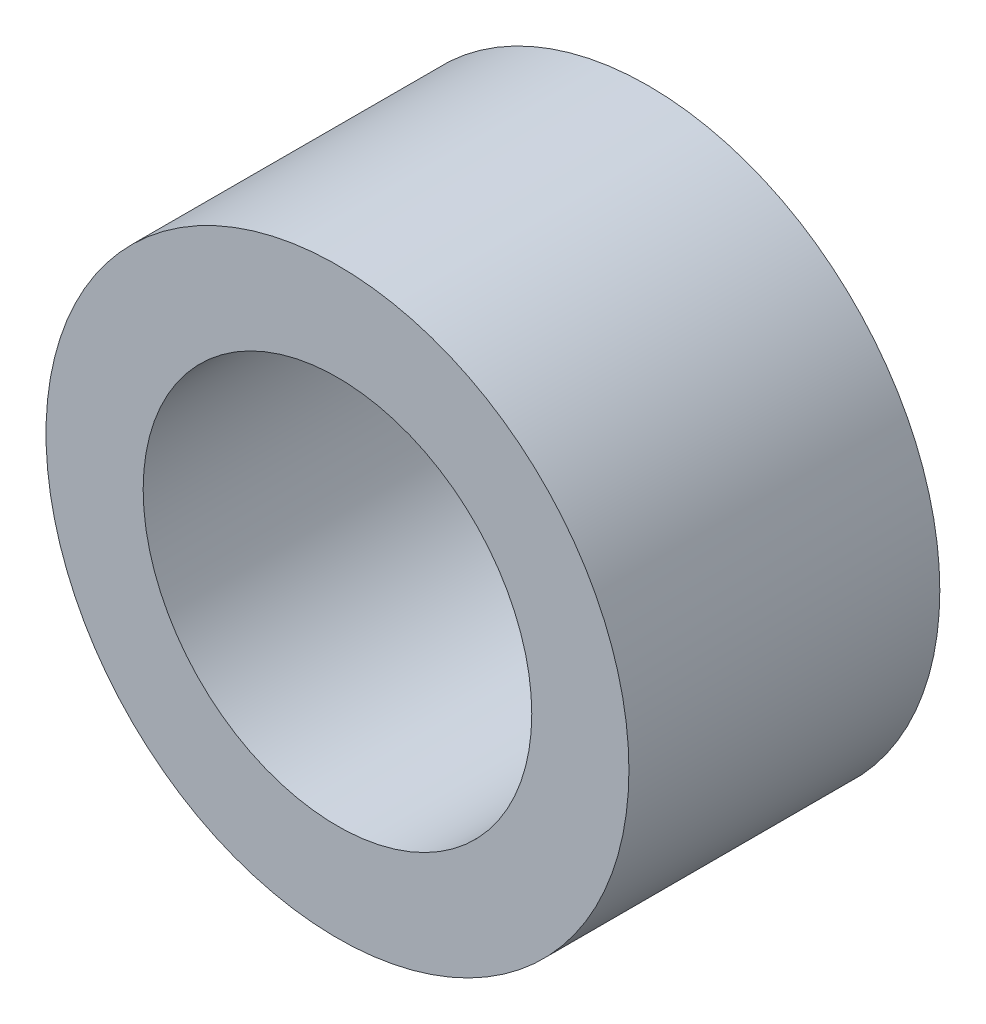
ISO-10303-21;
HEADER;
FILE_DESCRIPTION(('STEP AP214'),'2;1');
FILE_NAME('part.step','',(''),(''),'','','');
FILE_SCHEMA(('AUTOMOTIVE_DESIGN { 1 0 10303 214 1 1 1 1 }'));
ENDSEC;
DATA;
#1=APPLICATION_CONTEXT('core data for automotive mechanical design processes');
#2=APPLICATION_PROTOCOL_DEFINITION('international standard','automotive_design',2000,#1);
#3=PRODUCT_CONTEXT('',#1,'mechanical');
#4=PRODUCT('Part','Part','',(#3));
#5=PRODUCT_RELATED_PRODUCT_CATEGORY('part','',(#4));
#6=PRODUCT_DEFINITION_FORMATION('','',#4);
#7=PRODUCT_DEFINITION_CONTEXT('part definition',#1,'design');
#8=PRODUCT_DEFINITION('design','',#6,#7);
#9=PRODUCT_DEFINITION_SHAPE('','',#8);
#10=(LENGTH_UNIT() NAMED_UNIT(*) SI_UNIT(.MILLI.,.METRE.));
#11=(NAMED_UNIT(*) PLANE_ANGLE_UNIT() SI_UNIT($,.RADIAN.));
#12=(NAMED_UNIT(*) SI_UNIT($,.STERADIAN.) SOLID_ANGLE_UNIT());
#13=UNCERTAINTY_MEASURE_WITH_UNIT(LENGTH_MEASURE(1.E-05),#10,'distance_accuracy_value','');
#14=(GEOMETRIC_REPRESENTATION_CONTEXT(3) GLOBAL_UNCERTAINTY_ASSIGNED_CONTEXT((#13)) GLOBAL_UNIT_ASSIGNED_CONTEXT((#10,
#11,#12)) REPRESENTATION_CONTEXT('',''));
#15=CARTESIAN_POINT('',(0.,0.,0.));
#16=DIRECTION('',(0.,0.,1.));
#17=DIRECTION('',(1.,0.,0.));
#18=AXIS2_PLACEMENT_3D('',#15,#16,#17);
#19=CARTESIAN_POINT('',(0.,0.,-58.4264068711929));
#20=DIRECTION('',(0.,0.,1.));
#21=DIRECTION('',(1.,0.,0.));
#22=AXIS2_PLACEMENT_3D('',#19,#20,#21);
#23=CYLINDRICAL_SURFACE('',#22,15.);
#24=CARTESIAN_POINT('',(0.,0.,0.));
#25=DIRECTION('',(0.,0.,1.));
#26=DIRECTION('',(1.,0.,0.));
#27=AXIS2_PLACEMENT_3D('',#24,#25,#26);
#28=CIRCLE('',#27,15.);
#29=CARTESIAN_POINT('',(15.,0.,0.));
#30=VERTEX_POINT('',#29);
#31=EDGE_CURVE('E37',#30,#30,#28,.T.);
#32=ORIENTED_EDGE('',*,*,#31,.F.);
#33=EDGE_LOOP('',(#32));
#34=FACE_BOUND('',#33,.T.);
#35=CARTESIAN_POINT('',(0.,0.,-16.));
#36=DIRECTION('',(0.,0.,-1.));
#37=DIRECTION('',(-1.,0.,0.));
#38=AXIS2_PLACEMENT_3D('',#35,#36,#37);
#39=CIRCLE('',#38,15.);
#40=CARTESIAN_POINT('',(-15.,0.,-16.));
#41=VERTEX_POINT('',#40);
#42=EDGE_CURVE('E46',#41,#41,#39,.F.);
#43=ORIENTED_EDGE('',*,*,#42,.T.);
#44=EDGE_LOOP('',(#43));
#45=FACE_BOUND('',#44,.T.);
#46=ADVANCED_FACE('F30',(#34,#45),#23,.T.);
#47=CARTESIAN_POINT('',(0.,0.,-58.4264068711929));
#48=DIRECTION('',(0.,0.,1.));
#49=DIRECTION('',(1.,0.,0.));
#50=AXIS2_PLACEMENT_3D('',#47,#48,#49);
#51=CYLINDRICAL_SURFACE('',#50,10.);
#52=CARTESIAN_POINT('',(0.,0.,0.));
#53=DIRECTION('',(0.,0.,1.));
#54=DIRECTION('',(1.,0.,0.));
#55=AXIS2_PLACEMENT_3D('',#52,#53,#54);
#56=CIRCLE('',#55,10.);
#57=CARTESIAN_POINT('',(10.,0.,0.));
#58=VERTEX_POINT('',#57);
#59=EDGE_CURVE('E41',#58,#58,#56,.T.);
#60=ORIENTED_EDGE('',*,*,#59,.T.);
#61=EDGE_LOOP('',(#60));
#62=FACE_BOUND('',#61,.T.);
#63=CARTESIAN_POINT('',(0.,0.,-16.));
#64=DIRECTION('',(0.,0.,-1.));
#65=DIRECTION('',(-1.,0.,0.));
#66=AXIS2_PLACEMENT_3D('',#63,#64,#65);
#67=CIRCLE('',#66,10.);
#68=CARTESIAN_POINT('',(-10.,0.,-16.));
#69=VERTEX_POINT('',#68);
#70=EDGE_CURVE('E10',#69,#69,#67,.F.);
#71=ORIENTED_EDGE('',*,*,#70,.F.);
#72=EDGE_LOOP('',(#71));
#73=FACE_BOUND('',#72,.T.);
#74=ADVANCED_FACE('F57',(#62,#73),#51,.F.);
#75=CARTESIAN_POINT('',(0.,0.,0.));
#76=DIRECTION('',(0.,0.,1.));
#77=DIRECTION('',(1.,0.,0.));
#78=AXIS2_PLACEMENT_3D('',#75,#76,#77);
#79=PLANE('',#78);
#80=ORIENTED_EDGE('',*,*,#59,.F.);
#81=EDGE_LOOP('',(#80));
#82=FACE_BOUND('',#81,.T.);
#83=ORIENTED_EDGE('',*,*,#31,.T.);
#84=EDGE_LOOP('',(#83));
#85=FACE_BOUND('',#84,.T.);
#86=ADVANCED_FACE('F53',(#82,#85),#79,.T.);
#87=CARTESIAN_POINT('',(0.,0.,-16.));
#88=DIRECTION('',(0.,0.,-1.));
#89=DIRECTION('',(-1.,0.,0.));
#90=AXIS2_PLACEMENT_3D('',#87,#88,#89);
#91=PLANE('',#90);
#92=ORIENTED_EDGE('',*,*,#42,.F.);
#93=EDGE_LOOP('',(#92));
#94=FACE_BOUND('',#93,.T.);
#95=ORIENTED_EDGE('',*,*,#70,.T.);
#96=EDGE_LOOP('',(#95));
#97=FACE_BOUND('',#96,.T.);
#98=ADVANCED_FACE('F32',(#94,#97),#91,.T.);
#99=CLOSED_SHELL('',(#46,#74,#86,#98));
#100=MANIFOLD_SOLID_BREP('B2',#99);
#101=ADVANCED_BREP_SHAPE_REPRESENTATION('',(#18,#100),#14);
#102=SHAPE_DEFINITION_REPRESENTATION(#9,#101);
ENDSEC;
END-ISO-10303-21;
